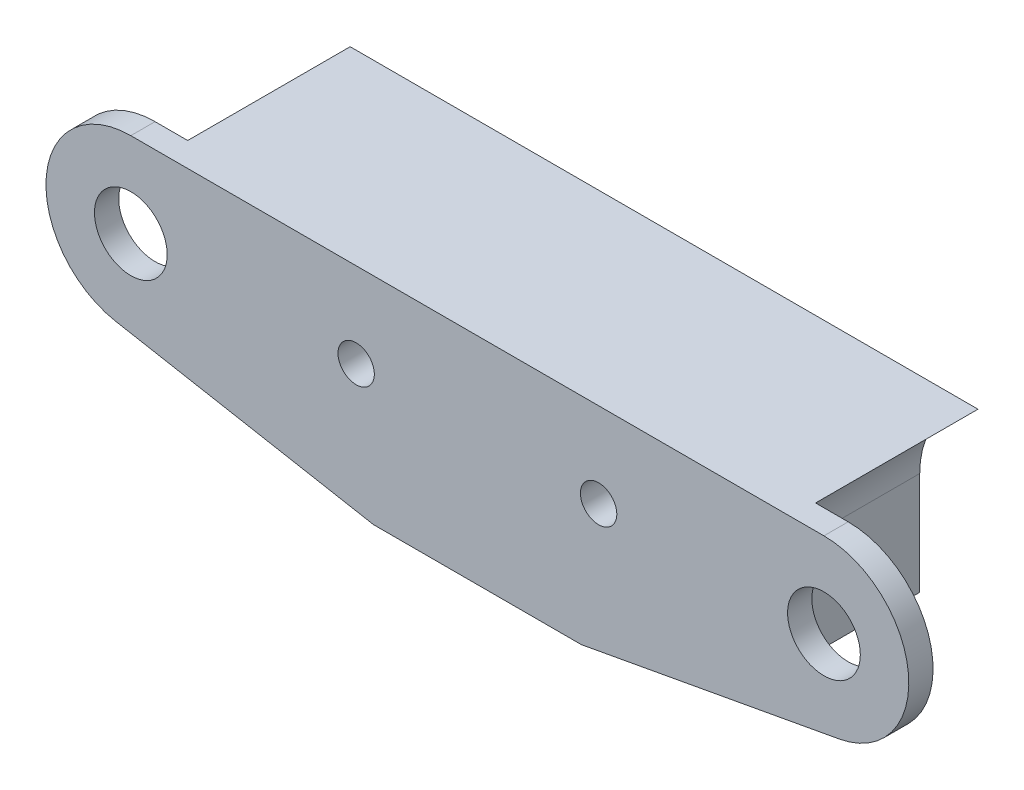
from build123d import *

# Parameters (mm, degrees)
CROQUIS1_R                 = 3
CROQUIS1_R_2               = 1.5
SALIENTE_EXTRUIR2_DEPTH    = 5
SALIENTE_EXTRUIR2_2_DEPTH  = 5
CROQUIS2_R                 = 3
CROQUIS2_R_2               = 1.5
SALIENTE_EXTRUIR3_DEPTH    = 2
SALIENTE_EXTRUIR4_START    = 4.4
CROQUIS3_R                 = 1.5
CROQUIS3_R_2               = 3
SALIENTE_EXTRUIR4_DEPTH    = 4.4
SALIENTE_EXTRUIR5_START    = -2
SALIENTE_EXTRUIR5_DEPTH    = 2
CORTAR_EXTRUIR1_DEPTH      = 69.824387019
CROQUIS7_R                 = 1.5
SALIENTE_EXTRUIR6_DEPTH    = 2
SALIENTE_EXTRUIR7_DEPTH    = 13.4
CROQUIS9_R                 = 3
CROQUIS9_R_2               = 1.5
SALIENTE_EXTRUIR8_DEPTH    = 13.4
CORTAR_EXTRUIR2_DEPTH      = 70.897040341
CORTAR_EXTRUIR2_DEPTH_BACK = 70.897040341
CROQUIS11_R                = 1.5


with BuildPart() as part:
    # Croquis1 → Saliente-Extruir2 (new body)
    with BuildSketch(Plane.XY):
        with Locations((0, 48.423091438)):
            Circle(CROQUIS1_R)
        with Locations((0, 48.423091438)):
            Circle(CROQUIS1_R_2, mode=Mode.SUBTRACT)
    extrude(amount=SALIENTE_EXTRUIR2_DEPTH)



with BuildPart() as body_2:
    # Croquis1 → Saliente-Extruir2 2 (new body)
    with BuildSketch(Plane.XY):
        with BuildLine():
            Line((-22.587599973, 51.154612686), (-22.587599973, 44.973090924))
            Line((-22.587599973, 44.973090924), (-8.393098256, 42.374491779))
            Line((-8.393098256, 42.374491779), (8.393098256, 42.374491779))
            Line((8.393098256, 42.374491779), (22.587599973, 44.973090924))
            Line((22.587599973, 44.973090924), (22.587599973, 51.154612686))
            ThreePointArc((22.587599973, 51.154612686), (23.300835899, 53.991887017), (25.270975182, 56.154612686))
            Line((25.270975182, 56.154612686), (-25.270975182, 56.154612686))
            ThreePointArc((-25.270975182, 56.154612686), (-23.300835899, 53.991887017), (-22.587599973, 51.154612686))
        make_face()
        with Locations((19.078407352, 51.154612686)):
            Circle(CROQUIS1_R_2, mode=Mode.SUBTRACT)
        with Locations((-19.078407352, 51.154612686)):
            Circle(CROQUIS1_R_2, mode=Mode.SUBTRACT)
        with BuildLine():
            Line((-20.587599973, 46.551277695), (-20.587599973, 48.561865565))
            ThreePointArc((-20.587599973, 48.561865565), (-16.182009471, 50.373024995), (-19.078407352, 54.154612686))
            Line((-19.078407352, 54.154612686), (19.078407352, 54.154612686))
            ThreePointArc((19.078407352, 54.154612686), (16.182009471, 50.373024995), (20.587599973, 48.561865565))
            Line((20.587599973, 48.561865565), (20.587599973, 46.606949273))
            Line((20.587599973, 46.606949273), (8.393098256, 44.374491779))
            Line((8.393098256, 44.374491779), (-8.697196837, 44.374491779))
            Line((-8.697196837, 44.374491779), (-20.587599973, 46.551277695))
        make_face(mode=Mode.SUBTRACT)
    extrude(amount=SALIENTE_EXTRUIR2_2_DEPTH)


with BuildPart() as part_1:
    add(part.part)

    add(body_2.part)  # Saliente-Extruir3 merges body 2
    # Croquis2 → Saliente-Extruir3 (add)
    with BuildSketch(Plane.XY.offset(5)):
        with BuildLine():
            Line((28.587599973, 56.154612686), (25.270975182, 56.154612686))
            Line((25.270975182, 56.154612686), (-25.270975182, 56.154612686))
            Line((-25.270975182, 56.154612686), (-28.587599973, 56.154612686))
            ThreePointArc((-28.587599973, 56.154612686), (-33.567123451, 51.606659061), (-29.487990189, 46.236351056))
            Line((-29.487990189, 46.236351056), (-22.587599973, 44.973090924))
            Line((-22.587599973, 44.973090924), (-8.393098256, 42.374491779))
            Line((-8.393098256, 42.374491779), (8.393098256, 42.374491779))
            Line((8.393098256, 42.374491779), (22.587599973, 44.973090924))
            Line((22.587599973, 44.973090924), (29.487990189, 46.236351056))
            ThreePointArc((29.487990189, 46.236351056), (33.567123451, 51.606659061), (28.587599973, 56.154612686))
        make_face()
        with Locations((-28.587599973, 51.154612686)):
            Circle(CROQUIS2_R, mode=Mode.SUBTRACT)
        with Locations((-19.078407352, 51.154612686)):
            Circle(CROQUIS2_R_2, mode=Mode.SUBTRACT)
        with Locations((0, 48.423091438)):
            Circle(CROQUIS2_R_2, mode=Mode.SUBTRACT)
        with Locations((19.078407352, 51.154612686)):
            Circle(CROQUIS2_R_2, mode=Mode.SUBTRACT)
        with Locations((28.587599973, 51.154612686)):
            Circle(CROQUIS2_R, mode=Mode.SUBTRACT)
    extrude(amount=SALIENTE_EXTRUIR3_DEPTH)

    # Croquis3 → Saliente-Extruir4 (add)
    # profile 1 of 2: a face of its own
    with BuildSketch(Plane(origin=(0, 0, 0), x_dir=(-1, 0, 0), z_dir=(0, 0, -1)).offset(SALIENTE_EXTRUIR4_START)):
        with BuildLine():
            Line((25.270975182, 56.154612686), (-25.270975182, 56.154612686))
            ThreePointArc((-25.270975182, 56.154612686), (-23.300835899, 53.991887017), (-22.587599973, 51.154612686))
            Line((-22.587599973, 51.154612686), (-22.587599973, 44.973090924))
            Line((-22.587599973, 44.973090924), (-8.393098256, 42.374491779))
            Line((-8.393098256, 42.374491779), (8.393098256, 42.374491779))
            Line((8.393098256, 42.374491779), (22.587599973, 44.973090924))
            Line((22.587599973, 44.973090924), (22.587599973, 51.154612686))
            ThreePointArc((22.587599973, 51.154612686), (23.300835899, 53.991887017), (25.270975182, 56.154612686))
        make_face()
        with Locations((19.078407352, 51.154612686)):
            Circle(CROQUIS3_R, mode=Mode.SUBTRACT)
        with Locations((-19.078407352, 51.154612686)):
            Circle(CROQUIS3_R, mode=Mode.SUBTRACT)
        with BuildLine():
            Line((-20.587599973, 46.606949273), (-20.587599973, 48.561865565))
            ThreePointArc((-20.587599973, 48.561865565), (-16.182009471, 50.373024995), (-19.078407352, 54.154612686))
            Line((-19.078407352, 54.154612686), (19.078407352, 54.154612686))
            ThreePointArc((19.078407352, 54.154612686), (16.182009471, 50.373024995), (20.587599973, 48.561865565))
            Line((20.587599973, 48.561865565), (20.587599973, 46.551277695))
            Line((20.587599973, 46.551277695), (8.697196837, 44.374491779))
            Line((8.697196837, 44.374491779), (-8.393098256, 44.374491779))
            Line((-8.393098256, 44.374491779), (-20.587599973, 46.606949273))
        make_face(mode=Mode.SUBTRACT)
    # profile 2 of 2: a face of its own
    with BuildSketch(Plane(origin=(0, 0, 0), x_dir=(-1, 0, 0), z_dir=(0, 0, -1)).offset(SALIENTE_EXTRUIR4_START)):
        with Locations((0, 48.423091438)):
            Circle(CROQUIS3_R_2)
        with Locations((0, 48.423091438)):
            Circle(CROQUIS3_R, mode=Mode.SUBTRACT)
    extrude(amount=-SALIENTE_EXTRUIR4_DEPTH)

    # Croquis4 → Saliente-Extruir5 (add)
    with BuildSketch(Plane.XY.offset(7).offset(SALIENTE_EXTRUIR5_START)):
        with BuildLine():
            Line((28.587599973, 58.154612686), (-28.587599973, 58.154612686))
            ThreePointArc((-28.587599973, 58.154612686), (-35.558932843, 51.787477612), (-29.848146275, 44.269046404))
            Line((-29.848146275, 44.269046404), (-8.574660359, 40.374491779))
            Line((-8.574660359, 40.374491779), (8.574660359, 40.374491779))
            Line((8.574660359, 40.374491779), (29.848146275, 44.269046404))
            ThreePointArc((29.848146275, 44.269046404), (35.558932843, 51.787477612), (28.587599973, 58.154612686))
        make_face()
        with BuildLine():
            Line((28.587599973, 56.154612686), (-28.587599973, 56.154612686))
            ThreePointArc((-28.587599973, 56.154612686), (-33.567123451, 51.606659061), (-29.487990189, 46.236351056))
            Line((-29.487990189, 46.236351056), (-8.393098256, 42.374491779))
            Line((-8.393098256, 42.374491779), (8.393098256, 42.374491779))
            Line((8.393098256, 42.374491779), (29.487990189, 46.236351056))
            ThreePointArc((29.487990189, 46.236351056), (33.567123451, 51.606659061), (28.587599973, 56.154612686))
        make_face(mode=Mode.SUBTRACT)
    extrude(amount=SALIENTE_EXTRUIR5_DEPTH)

    # Croquis6 → Cortar-Extruir1 (cut, through all)
    with BuildSketch(Plane(origin=(0, 0, 5), x_dir=(-1, 0, 0), z_dir=(0, 0, -1))):
        with BuildLine():
            Line((-29.848146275, 44.269046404), (-8.574660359, 40.374491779))
            Line((-8.574660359, 40.374491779), (8.574660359, 40.374491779))
            Line((8.574660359, 40.374491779), (29.848146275, 44.269046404))
            ThreePointArc((29.848146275, 44.269046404), (35.558932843, 51.787477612), (28.587599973, 58.154612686))
            Line((28.587599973, 58.154612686), (-28.587599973, 58.154612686))
            ThreePointArc((-28.587599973, 58.154612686), (-35.558932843, 51.787477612), (-29.848146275, 44.269046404))
        make_face()
    extrude(amount=CORTAR_EXTRUIR1_DEPTH, mode=Mode.SUBTRACT)

    # Croquis7 → Saliente-Extruir6 (add)
    with BuildSketch(Plane(origin=(0, 0, 5), x_dir=(-1, 0, 0), z_dir=(0, 0, -1))):
        with Locations((-19.078407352, 51.154612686)):
            Circle(CROQUIS7_R)
        with Locations((0, 48.423091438)):
            Circle(CROQUIS7_R)
        with Locations((19.078407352, 51.154612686)):
            Circle(CROQUIS7_R)
    extrude(amount=-SALIENTE_EXTRUIR6_DEPTH)

    # Croquis8 → Saliente-Extruir7 (add)
    with BuildSketch(Plane(origin=(0, 0, 5), x_dir=(-1, 0, 0), z_dir=(0, 0, -1))):
        with BuildLine():
            Line((-25.895017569, 58.154612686), (25.895017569, 58.154612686))
            ThreePointArc((25.895017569, 58.154612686), (22.405190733, 55.400530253), (21.087599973, 51.154612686))
            Line((21.087599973, 51.154612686), (21.087599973, 42.665245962))
            Line((21.087599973, 42.665245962), (8.574660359, 40.374491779))
            Line((8.574660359, 40.374491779), (-8.574660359, 40.374491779))
            Line((-8.574660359, 40.374491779), (-21.087599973, 42.665245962))
            Line((-21.087599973, 42.665245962), (-21.087599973, 51.154612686))
            ThreePointArc((-21.087599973, 51.154612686), (-22.405190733, 55.400530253), (-25.895017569, 58.154612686))
        make_face()
        with BuildLine():
            Line((-20.509852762, 56.154612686), (20.509852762, 56.154612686))
            ThreePointArc((20.509852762, 56.154612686), (19.450078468, 53.753785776), (19.087599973, 51.154612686))
            Line((19.087599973, 51.154612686), (19.087599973, 44.332343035))
            Line((19.087599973, 44.332343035), (8.393098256, 42.374491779))
            Line((8.393098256, 42.374491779), (-8.393098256, 42.374491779))
            Line((-8.393098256, 42.374491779), (-19.087599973, 44.332343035))
            Line((-19.087599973, 44.332343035), (-19.087599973, 51.154612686))
            ThreePointArc((-19.087599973, 51.154612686), (-19.450078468, 53.753785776), (-20.509852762, 56.154612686))
        make_face(mode=Mode.SUBTRACT)
    extrude(amount=SALIENTE_EXTRUIR7_DEPTH)

    # Croquis9 → Saliente-Extruir8 (add)
    # profile 1 of 2: a face of its own
    with BuildSketch(Plane(origin=(0, 0, 5), x_dir=(-1, 0, 0), z_dir=(0, 0, -1))):
        with Locations(Location((-10, 51.154612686, 0), (0, 0, 180))):
            Circle(CROQUIS9_R)
        with Locations((-10, 51.154612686)):
            Circle(CROQUIS9_R_2, mode=Mode.SUBTRACT)
    # profile 2 of 2: a face of its own
    with BuildSketch(Plane(origin=(0, 0, 5), x_dir=(-1, 0, 0), z_dir=(0, 0, -1))):
        with Locations(Location((10, 51.154612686, 0), (0, 0, 180))):
            Circle(CROQUIS9_R)
        with Locations(Location((10, 51.154612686, 0), (0, 0, 180))):
            Circle(CROQUIS9_R_2, mode=Mode.SUBTRACT)
    extrude(amount=SALIENTE_EXTRUIR8_DEPTH)

    # Croquis11 → Cortar-Extruir2 (cut, two sides: drawn at the far end of the back side and taken through both)
    with BuildSketch(Plane(origin=(0, 0, -8.4), x_dir=(-1, 0, 0), z_dir=(0, 0, -1)).offset(-CORTAR_EXTRUIR2_DEPTH_BACK)):
        with Locations((-10, 51.154612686)):
            Circle(CROQUIS11_R)
        with Locations((10, 51.154612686)):
            Circle(CROQUIS11_R)
    extrude(amount=CORTAR_EXTRUIR2_DEPTH + CORTAR_EXTRUIR2_DEPTH_BACK, mode=Mode.SUBTRACT)


solid = part_1.part
